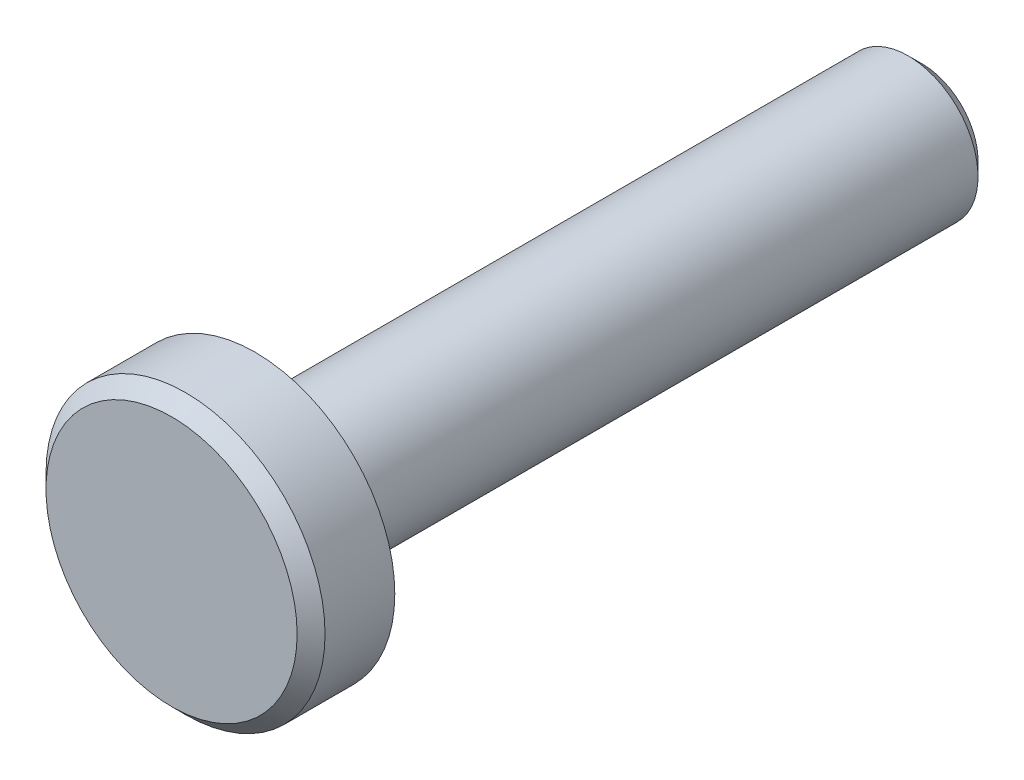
ISO-10303-21;
HEADER;
FILE_DESCRIPTION(('STEP AP214'),'2;1');
FILE_NAME('part.step','',(''),(''),'','','');
FILE_SCHEMA(('AUTOMOTIVE_DESIGN { 1 0 10303 214 1 1 1 1 }'));
ENDSEC;
DATA;
#1=APPLICATION_CONTEXT('core data for automotive mechanical design processes');
#2=APPLICATION_PROTOCOL_DEFINITION('international standard','automotive_design',2000,#1);
#3=PRODUCT_CONTEXT('',#1,'mechanical');
#4=PRODUCT('Part','Part','',(#3));
#5=PRODUCT_RELATED_PRODUCT_CATEGORY('part','',(#4));
#6=PRODUCT_DEFINITION_FORMATION('','',#4);
#7=PRODUCT_DEFINITION_CONTEXT('part definition',#1,'design');
#8=PRODUCT_DEFINITION('design','',#6,#7);
#9=PRODUCT_DEFINITION_SHAPE('','',#8);
#10=(LENGTH_UNIT() NAMED_UNIT(*) SI_UNIT(.MILLI.,.METRE.));
#11=(NAMED_UNIT(*) PLANE_ANGLE_UNIT() SI_UNIT($,.RADIAN.));
#12=(NAMED_UNIT(*) SI_UNIT($,.STERADIAN.) SOLID_ANGLE_UNIT());
#13=UNCERTAINTY_MEASURE_WITH_UNIT(LENGTH_MEASURE(1.E-05),#10,'distance_accuracy_value','');
#14=(GEOMETRIC_REPRESENTATION_CONTEXT(3) GLOBAL_UNCERTAINTY_ASSIGNED_CONTEXT((#13)) GLOBAL_UNIT_ASSIGNED_CONTEXT((#10,
#11,#12)) REPRESENTATION_CONTEXT('',''));
#15=CARTESIAN_POINT('',(0.,0.,0.));
#16=DIRECTION('',(0.,0.,1.));
#17=DIRECTION('',(1.,0.,0.));
#18=AXIS2_PLACEMENT_3D('',#15,#16,#17);
#19=CARTESIAN_POINT('',(-4.21307488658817,-17.5,5.7));
#20=DIRECTION('',(0.,0.,-1.));
#21=DIRECTION('',(-1.,0.,0.));
#22=AXIS2_PLACEMENT_3D('',#19,#20,#21);
#23=CYLINDRICAL_SURFACE('',#22,1.25);
#24=CARTESIAN_POINT('',(-4.21307488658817,-17.5,-5.99999999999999));
#25=DIRECTION('',(0.,0.,-1.));
#26=DIRECTION('',(-1.,0.,0.));
#27=AXIS2_PLACEMENT_3D('',#24,#25,#26);
#28=CIRCLE('',#27,1.25);
#29=CARTESIAN_POINT('',(-5.46307488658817,-17.5,-5.99999999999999));
#30=VERTEX_POINT('',#29);
#31=EDGE_CURVE('E34',#30,#30,#28,.F.);
#32=ORIENTED_EDGE('',*,*,#31,.T.);
#33=EDGE_LOOP('',(#32));
#34=FACE_BOUND('',#33,.T.);
#35=CARTESIAN_POINT('',(-4.21307488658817,-17.5,5.7));
#36=DIRECTION('',(0.,0.,1.));
#37=DIRECTION('',(1.,0.,0.));
#38=AXIS2_PLACEMENT_3D('',#35,#36,#37);
#39=CIRCLE('',#38,1.25);
#40=CARTESIAN_POINT('',(-2.96307488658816,-17.5,5.7));
#41=VERTEX_POINT('',#40);
#42=EDGE_CURVE('E47',#41,#41,#39,.T.);
#43=ORIENTED_EDGE('',*,*,#42,.F.);
#44=EDGE_LOOP('',(#43));
#45=FACE_BOUND('',#44,.T.);
#46=ADVANCED_FACE('F28',(#34,#45),#23,.T.);
#47=CARTESIAN_POINT('',(-4.21307488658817,-17.5,-6.25));
#48=DIRECTION('',(0.,0.,-1.));
#49=DIRECTION('',(-1.,0.,0.));
#50=AXIS2_PLACEMENT_3D('',#47,#48,#49);
#51=PLANE('',#50);
#52=CARTESIAN_POINT('',(-4.21307488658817,-17.5,-6.25));
#53=DIRECTION('',(0.,0.,-1.));
#54=DIRECTION('',(-1.,0.,0.));
#55=AXIS2_PLACEMENT_3D('',#52,#53,#54);
#56=CIRCLE('',#55,1.);
#57=CARTESIAN_POINT('',(-5.21307488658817,-17.5,-6.25));
#58=VERTEX_POINT('',#57);
#59=EDGE_CURVE('E10',#58,#58,#56,.T.);
#60=ORIENTED_EDGE('',*,*,#59,.T.);
#61=EDGE_LOOP('',(#60));
#62=FACE_BOUND('',#61,.T.);
#63=ADVANCED_FACE('F59',(#62),#51,.T.);
#64=CARTESIAN_POINT('',(-4.21307488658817,-17.5,5.7));
#65=DIRECTION('',(0.,0.,1.));
#66=DIRECTION('',(1.,0.,0.));
#67=AXIS2_PLACEMENT_3D('',#64,#65,#66);
#68=PLANE('',#67);
#69=CARTESIAN_POINT('',(-4.21307488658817,-17.5,5.7));
#70=DIRECTION('',(0.,0.,1.));
#71=DIRECTION('',(1.,0.,0.));
#72=AXIS2_PLACEMENT_3D('',#69,#70,#71);
#73=CIRCLE('',#72,2.5);
#74=CARTESIAN_POINT('',(-1.71307488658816,-17.5,5.7));
#75=VERTEX_POINT('',#74);
#76=EDGE_CURVE('E50',#75,#75,#73,.T.);
#77=ORIENTED_EDGE('',*,*,#76,.F.);
#78=EDGE_LOOP('',(#77));
#79=FACE_BOUND('',#78,.T.);
#80=ORIENTED_EDGE('',*,*,#42,.T.);
#81=EDGE_LOOP('',(#80));
#82=FACE_BOUND('',#81,.T.);
#83=ADVANCED_FACE('F56',(#79,#82),#68,.F.);
#84=CARTESIAN_POINT('',(-4.21307488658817,-17.5,7.2));
#85=DIRECTION('',(0.,0.,-1.));
#86=DIRECTION('',(-1.,0.,0.));
#87=AXIS2_PLACEMENT_3D('',#84,#85,#86);
#88=CYLINDRICAL_SURFACE('',#87,2.5);
#89=CARTESIAN_POINT('',(-4.21307488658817,-17.5,6.95));
#90=DIRECTION('',(0.,0.,1.));
#91=DIRECTION('',(1.,0.,0.));
#92=AXIS2_PLACEMENT_3D('',#89,#90,#91);
#93=CIRCLE('',#92,2.5);
#94=CARTESIAN_POINT('',(-1.71307488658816,-17.5,6.95));
#95=VERTEX_POINT('',#94);
#96=EDGE_CURVE('E38',#95,#95,#93,.F.);
#97=ORIENTED_EDGE('',*,*,#96,.T.);
#98=EDGE_LOOP('',(#97));
#99=FACE_BOUND('',#98,.T.);
#100=ORIENTED_EDGE('',*,*,#76,.T.);
#101=EDGE_LOOP('',(#100));
#102=FACE_BOUND('',#101,.T.);
#103=ADVANCED_FACE('F54',(#99,#102),#88,.T.);
#104=CARTESIAN_POINT('',(-4.21307488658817,-17.5,7.2));
#105=DIRECTION('',(0.,0.,1.));
#106=DIRECTION('',(1.,0.,0.));
#107=AXIS2_PLACEMENT_3D('',#104,#105,#106);
#108=PLANE('',#107);
#109=CARTESIAN_POINT('',(-4.21307488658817,-17.5,7.2));
#110=DIRECTION('',(0.,0.,1.));
#111=DIRECTION('',(1.,0.,0.));
#112=AXIS2_PLACEMENT_3D('',#109,#110,#111);
#113=CIRCLE('',#112,2.25);
#114=CARTESIAN_POINT('',(-1.96307488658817,-17.5,7.2));
#115=VERTEX_POINT('',#114);
#116=EDGE_CURVE('E42',#115,#115,#113,.T.);
#117=ORIENTED_EDGE('',*,*,#116,.T.);
#118=EDGE_LOOP('',(#117));
#119=FACE_BOUND('',#118,.T.);
#120=ADVANCED_FACE('F72',(#119),#108,.T.);
#121=CARTESIAN_POINT('',(-4.21307488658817,-17.5,7.2));
#122=DIRECTION('',(0.,0.,-1.));
#123=DIRECTION('',(-1.,0.,0.));
#124=AXIS2_PLACEMENT_3D('',#121,#122,#123);
#125=CONICAL_SURFACE('',#124,2.25,0.785398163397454);
#126=ORIENTED_EDGE('',*,*,#96,.F.);
#127=EDGE_LOOP('',(#126));
#128=FACE_BOUND('',#127,.T.);
#129=ORIENTED_EDGE('',*,*,#116,.F.);
#130=EDGE_LOOP('',(#129));
#131=FACE_BOUND('',#130,.T.);
#132=ADVANCED_FACE('F75',(#128,#131),#125,.T.);
#133=CARTESIAN_POINT('',(-4.21307488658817,-17.5,-5.99999999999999));
#134=DIRECTION('',(0.,0.,1.));
#135=DIRECTION('',(1.,0.,0.));
#136=AXIS2_PLACEMENT_3D('',#133,#134,#135);
#137=CONICAL_SURFACE('',#136,1.25,0.785398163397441);
#138=ORIENTED_EDGE('',*,*,#59,.F.);
#139=EDGE_LOOP('',(#138));
#140=FACE_BOUND('',#139,.T.);
#141=ORIENTED_EDGE('',*,*,#31,.F.);
#142=EDGE_LOOP('',(#141));
#143=FACE_BOUND('',#142,.T.);
#144=ADVANCED_FACE('F80',(#140,#143),#137,.T.);
#145=CLOSED_SHELL('',(#46,#63,#83,#103,#120,#132,#144));
#146=MANIFOLD_SOLID_BREP('B2',#145);
#147=ADVANCED_BREP_SHAPE_REPRESENTATION('',(#18,#146),#14);
#148=SHAPE_DEFINITION_REPRESENTATION(#9,#147);
ENDSEC;
END-ISO-10303-21;
